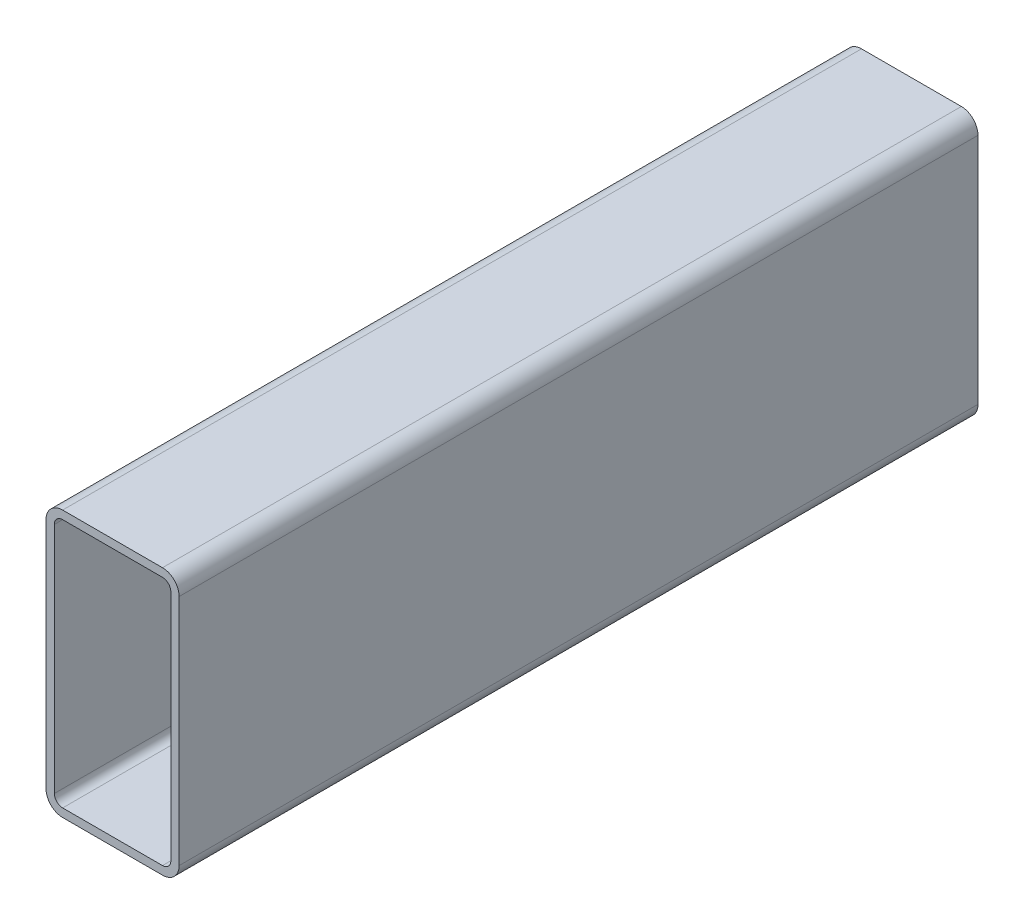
from build123d import *

# Parameters (mm, degrees)
BOSS_EXTRUDE1_DEPTH = 304.8


with BuildPart() as part:
    # Sketch1 → Boss-Extrude1 (new body)
    with BuildSketch(Plane.XY):
        with BuildLine():
            Line((6.35, 101.6), (44.45, 101.6))
            ThreePointArc((44.45, 101.6), (48.940128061, 99.740128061), (50.8, 95.25))
            Line((50.8, 95.25), (50.8, 6.35))
            ThreePointArc((50.8, 6.35), (48.940128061, 1.859871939), (44.45, 0))
            Line((44.45, 0), (6.35, 0))
            ThreePointArc((6.35, 0), (1.859871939, 1.859871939), (0, 6.35))
            Line((0, 6.35), (0, 95.25))
            ThreePointArc((0, 95.25), (1.859871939, 99.740128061), (6.35, 101.6))
        make_face()
        with BuildLine():
            Line((6.35, 98.425), (44.45, 98.425))
            ThreePointArc((44.45, 98.425), (46.69506403, 97.49506403), (47.625, 95.25))
            Line((47.625, 95.25), (47.625, 6.35))
            ThreePointArc((47.625, 6.35), (46.69506403, 4.10493597), (44.45, 3.175))
            Line((44.45, 3.175), (6.35, 3.175))
            ThreePointArc((6.35, 3.175), (4.10493597, 4.10493597), (3.175, 6.35))
            Line((3.175, 6.35), (3.175, 95.25))
            ThreePointArc((3.175, 95.25), (4.10493597, 97.49506403), (6.35, 98.425))
        make_face(mode=Mode.SUBTRACT)
    extrude(amount=BOSS_EXTRUDE1_DEPTH)


solid = part.part
